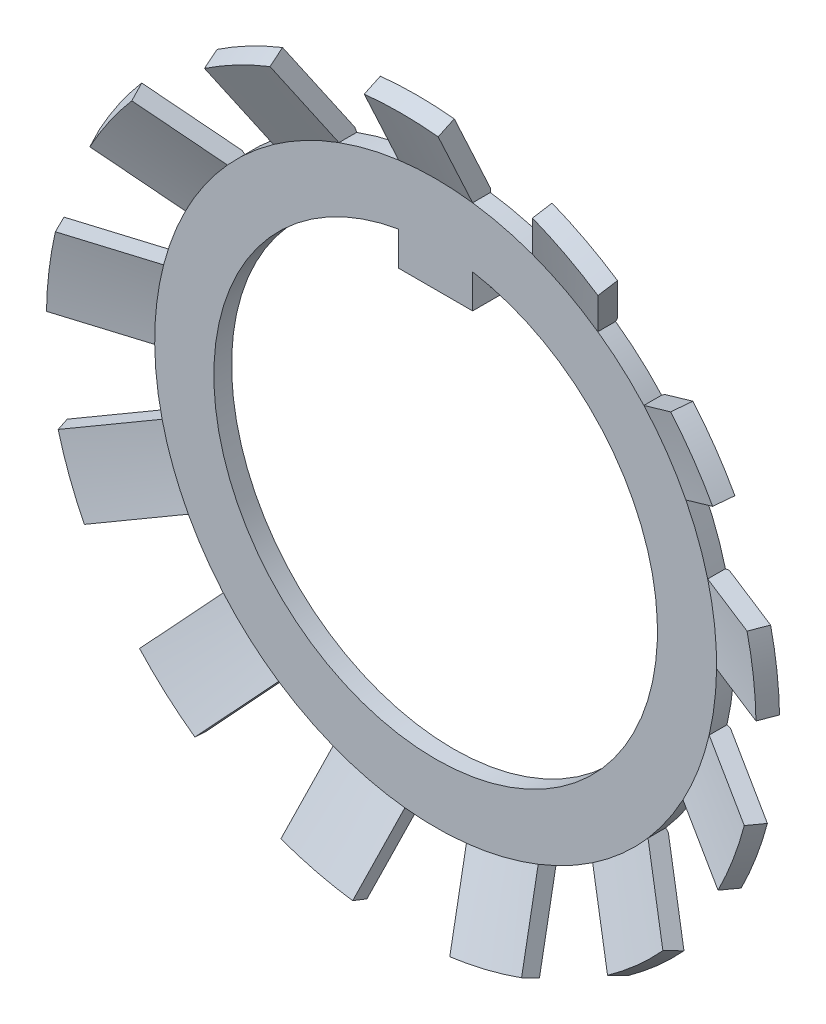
from build123d import *

# Parameters (mm, degrees)
BOSS_EXTRUDE1_DEPTH      = 2.5
BOSS_EXTRUDE1_DEPTH_BACK = 2.5
SKETCH3_R                = 49
CUT_EXTRUDE1_DEPTH       = 20


with BuildPart() as part:
    # Sketch1 → Revolve1 (revolve)
    with BuildSketch(Plane(origin=(0, 0, 0), x_dir=(0, 0, -1), z_dir=(1, 0, 0)), mode=Mode.PRIVATE) as revolve1_sk:
        Polygon((-3.528207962, 23.992858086), (-1.2, 19), (-1.2, 15), (0, 15), (0, 19.266033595), (-2.440638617, 24.5), align=None)
    revolve(revolve1_sk.sketch.rotate(Axis((0, 0, 0), (0, 0, 1)), 270), axis=Axis((0, 0, 0), (0, 0, 1)))

    # Sketch2 → Boss-Extrude1 (add, two sides: drawn at the far end of the back side and taken through both)
    with BuildSketch(Plane(origin=(0, 0, 0), x_dir=(0, 0, -1), z_dir=(1, 0, 0)).offset(-BOSS_EXTRUDE1_DEPTH_BACK)):
        Polygon((-1.2, 12.5), (1.3, 12.5), (1.3, 13.25), (0, 13.25), (0, 15), (-1.2, 15), align=None)
    extrude(amount=BOSS_EXTRUDE1_DEPTH + BOSS_EXTRUDE1_DEPTH_BACK)

    # Sketch3 → Cut-Extrude1 (cut)
    with BuildSketch(Plane.XY):
        Circle(SKETCH3_R)
        with BuildLine():
            Line((-24.495756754, 0.455961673), (-18.998822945, -0.211486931))
            ThreePointArc((-18.998822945, -0.211486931), (-18.861468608, -2.290196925), (-18.497363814, -4.341374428))
            Line((-18.497363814, -4.341374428), (-23.674835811, -6.304930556))
            ThreePointArc((-23.674835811, -6.304930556), (-22.907897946, -8.687819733), (-21.901811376, -10.980011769))
            Line((-21.901811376, -10.980011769), (-16.724339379, -9.016455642))
            ThreePointArc((-16.724339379, -9.016455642), (-15.636693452, -10.793230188), (-14.361064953, -12.440249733))
            Line((-14.361064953, -12.440249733), (-18.032978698, -16.584983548))
            ThreePointArc((-18.032978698, -16.584983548), (-16.246505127, -18.33851333), (-14.290424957, -19.900596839))
            Line((-14.290424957, -19.900596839), (-10.618511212, -15.755863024))
            ThreePointArc((-10.618511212, -15.755863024), (-8.829740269, -16.823664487), (-6.93481918, -17.689213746))
            Line((-6.93481918, -17.689213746), (-8.259983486, -23.06561668))
            ThreePointArc((-8.259983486, -23.06561668), (-5.863233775, -23.788074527), (-3.405274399, -24.262195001))
            Line((-3.405274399, -24.262195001), (-2.080110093, -18.885792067))
            ThreePointArc((-2.080110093, -18.885792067), (0, -19), (2.080110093, -18.885792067))
            Line((2.080110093, -18.885792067), (3.405274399, -24.262195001))
            ThreePointArc((3.405274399, -24.262195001), (5.863233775, -23.788074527), (8.259983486, -23.06561668))
            Line((8.259983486, -23.06561668), (6.93481918, -17.689213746))
            ThreePointArc((6.93481918, -17.689213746), (8.829740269, -16.823664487), (10.618511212, -15.755863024))
            Line((10.618511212, -15.755863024), (14.290424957, -19.900596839))
            ThreePointArc((14.290424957, -19.900596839), (16.246505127, -18.33851333), (18.032978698, -16.584983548))
            Line((18.032978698, -16.584983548), (14.361064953, -12.440249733))
            ThreePointArc((14.361064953, -12.440249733), (15.636693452, -10.793230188), (16.724339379, -9.016455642))
            Line((16.724339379, -9.016455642), (21.901811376, -10.980011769))
            ThreePointArc((21.901811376, -10.980011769), (22.907897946, -8.687819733), (23.674835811, -6.304930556))
            Line((23.674835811, -6.304930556), (18.497363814, -4.341374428))
            ThreePointArc((18.497363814, -4.341374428), (18.861468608, -2.290196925), (18.998822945, -0.211486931))
            Line((18.998822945, -0.211486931), (24.495756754, 0.455961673))
            ThreePointArc((24.495756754, 0.455961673), (24.321367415, 2.953148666), (23.893073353, 5.419506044))
            Line((23.893073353, 5.419506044), (18.396139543, 4.752057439))
            ThreePointArc((18.396139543, 4.752057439), (17.765308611, 6.737492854), (16.920905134, 8.641930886))
            Line((16.920905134, 8.641930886), (21.478019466, 11.787479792))
            ThreePointArc((21.478019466, 11.787479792), (20.163104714, 13.917586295), (18.637695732, 15.902399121))
            Line((18.637695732, 15.902399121), (14.0805814, 12.756850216))
            ThreePointArc((14.0805814, 12.756850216), (12.599330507, 14.221704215), (10.966611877, 15.515586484))
            Line((10.966611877, 15.515586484), (13.539926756, 20.418628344))
            ThreePointArc((13.539926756, 20.418628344), (11.385717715, 21.693672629), (9.112646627, 22.742244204))
            Line((9.112646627, 22.742244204), (6.539331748, 17.839202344))
            ThreePointArc((6.539331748, 17.839202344), (4.546997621, 18.447894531), (2.5, 18.834808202))
            Line((2.5, 18.834808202), (2.5, 24.372115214))
            ThreePointArc((2.5, 24.372115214), (0, 24.5), (-2.5, 24.372115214))
            Line((-2.5, 24.372115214), (-2.5, 18.834808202))
            ThreePointArc((-2.5, 18.834808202), (-4.546997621, 18.447894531), (-6.539331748, 17.839202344))
            Line((-6.539331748, 17.839202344), (-9.112646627, 22.742244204))
            ThreePointArc((-9.112646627, 22.742244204), (-11.385717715, 21.693672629), (-13.539926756, 20.418628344))
            Line((-13.539926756, 20.418628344), (-10.966611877, 15.515586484))
            ThreePointArc((-10.966611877, 15.515586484), (-12.599330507, 14.221704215), (-14.0805814, 12.756850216))
            Line((-14.0805814, 12.756850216), (-18.637695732, 15.902399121))
            ThreePointArc((-18.637695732, 15.902399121), (-20.163104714, 13.917586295), (-21.478019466, 11.787479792))
            Line((-21.478019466, 11.787479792), (-16.920905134, 8.641930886))
            ThreePointArc((-16.920905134, 8.641930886), (-17.765308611, 6.737492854), (-18.396139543, 4.752057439))
            Line((-18.396139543, 4.752057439), (-23.893073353, 5.419506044))
            ThreePointArc((-23.893073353, 5.419506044), (-24.321367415, 2.953148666), (-24.495756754, 0.455961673))
        make_face(mode=Mode.SUBTRACT)
    extrude(amount=CUT_EXTRUDE1_DEPTH, mode=Mode.SUBTRACT)


solid = part.part
